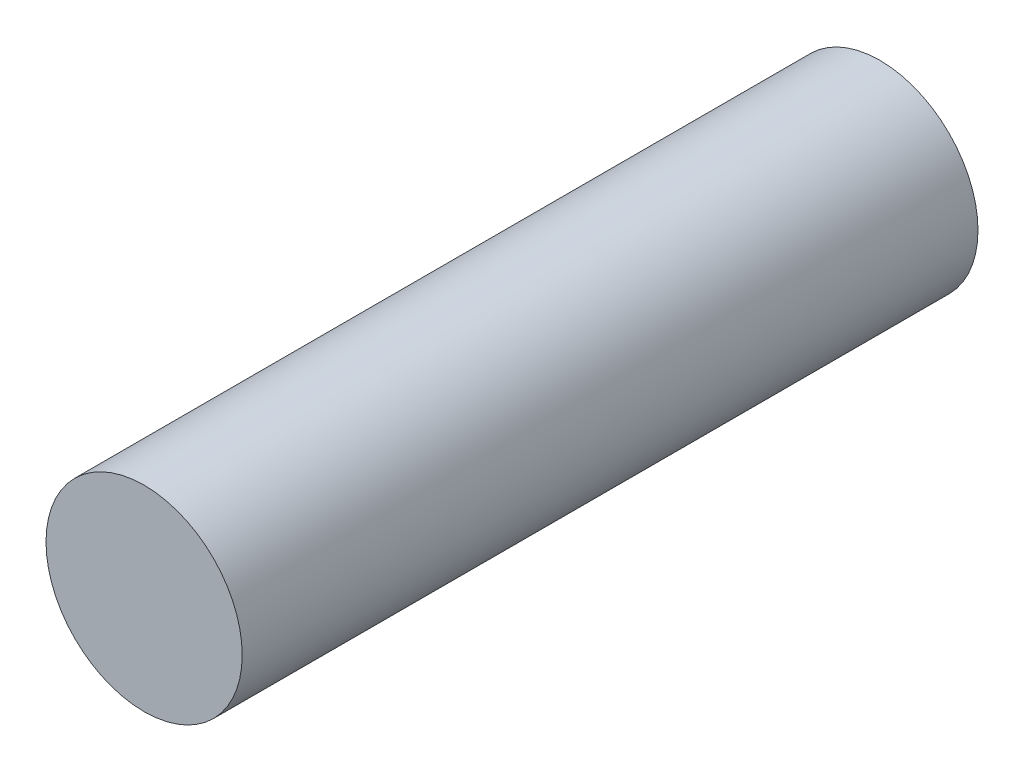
ISO-10303-21;
HEADER;
FILE_DESCRIPTION(('STEP AP214'),'2;1');
FILE_NAME('part.step','',(''),(''),'','','');
FILE_SCHEMA(('AUTOMOTIVE_DESIGN { 1 0 10303 214 1 1 1 1 }'));
ENDSEC;
DATA;
#1=APPLICATION_CONTEXT('core data for automotive mechanical design processes');
#2=APPLICATION_PROTOCOL_DEFINITION('international standard','automotive_design',2000,#1);
#3=PRODUCT_CONTEXT('',#1,'mechanical');
#4=PRODUCT('Part','Part','',(#3));
#5=PRODUCT_RELATED_PRODUCT_CATEGORY('part','',(#4));
#6=PRODUCT_DEFINITION_FORMATION('','',#4);
#7=PRODUCT_DEFINITION_CONTEXT('part definition',#1,'design');
#8=PRODUCT_DEFINITION('design','',#6,#7);
#9=PRODUCT_DEFINITION_SHAPE('','',#8);
#10=(LENGTH_UNIT() NAMED_UNIT(*) SI_UNIT(.MILLI.,.METRE.));
#11=(NAMED_UNIT(*) PLANE_ANGLE_UNIT() SI_UNIT($,.RADIAN.));
#12=(NAMED_UNIT(*) SI_UNIT($,.STERADIAN.) SOLID_ANGLE_UNIT());
#13=UNCERTAINTY_MEASURE_WITH_UNIT(LENGTH_MEASURE(1.E-05),#10,'distance_accuracy_value','');
#14=(GEOMETRIC_REPRESENTATION_CONTEXT(3) GLOBAL_UNCERTAINTY_ASSIGNED_CONTEXT((#13)) GLOBAL_UNIT_ASSIGNED_CONTEXT((#10,
#11,#12)) REPRESENTATION_CONTEXT('',''));
#15=CARTESIAN_POINT('',(0.,0.,0.));
#16=DIRECTION('',(0.,0.,1.));
#17=DIRECTION('',(1.,0.,0.));
#18=AXIS2_PLACEMENT_3D('',#15,#16,#17);
#19=CARTESIAN_POINT('',(0.,0.,-76.2));
#20=DIRECTION('',(0.,0.,1.));
#21=DIRECTION('',(1.,0.,0.));
#22=AXIS2_PLACEMENT_3D('',#19,#20,#21);
#23=CYLINDRICAL_SURFACE('',#22,10.16);
#24=CARTESIAN_POINT('',(0.,0.,-76.2));
#25=DIRECTION('',(0.,0.,1.));
#26=DIRECTION('',(1.,0.,0.));
#27=AXIS2_PLACEMENT_3D('',#24,#25,#26);
#28=CIRCLE('',#27,10.16);
#29=CARTESIAN_POINT('',(10.16,0.,-76.2));
#30=VERTEX_POINT('',#29);
#31=EDGE_CURVE('E10',#30,#30,#28,.T.);
#32=ORIENTED_EDGE('',*,*,#31,.T.);
#33=EDGE_LOOP('',(#32));
#34=FACE_BOUND('',#33,.T.);
#35=CARTESIAN_POINT('',(0.,0.,0.));
#36=DIRECTION('',(0.,0.,1.));
#37=DIRECTION('',(1.,0.,0.));
#38=AXIS2_PLACEMENT_3D('',#35,#36,#37);
#39=CIRCLE('',#38,10.16);
#40=CARTESIAN_POINT('',(10.16,0.,0.));
#41=VERTEX_POINT('',#40);
#42=EDGE_CURVE('E352',#41,#41,#39,.T.);
#43=ORIENTED_EDGE('',*,*,#42,.F.);
#44=EDGE_LOOP('',(#43));
#45=FACE_BOUND('',#44,.T.);
#46=ADVANCED_FACE('F346',(#34,#45),#23,.T.);
#47=CARTESIAN_POINT('',(0.,0.,-76.2));
#48=DIRECTION('',(0.,0.,1.));
#49=DIRECTION('',(1.,0.,0.));
#50=AXIS2_PLACEMENT_3D('',#47,#48,#49);
#51=PLANE('',#50);
#52=ORIENTED_EDGE('',*,*,#31,.F.);
#53=EDGE_LOOP('',(#52));
#54=FACE_BOUND('',#53,.T.);
#55=ADVANCED_FACE('F361',(#54),#51,.F.);
#56=CARTESIAN_POINT('',(0.,0.,0.));
#57=DIRECTION('',(0.,0.,1.));
#58=DIRECTION('',(1.,0.,0.));
#59=AXIS2_PLACEMENT_3D('',#56,#57,#58);
#60=PLANE('',#59);
#61=ORIENTED_EDGE('',*,*,#42,.T.);
#62=EDGE_LOOP('',(#61));
#63=FACE_BOUND('',#62,.T.);
#64=ADVANCED_FACE('F358',(#63),#60,.T.);
#65=CLOSED_SHELL('',(#46,#55,#64));
#66=MANIFOLD_SOLID_BREP('B2',#65);
#67=ADVANCED_BREP_SHAPE_REPRESENTATION('',(#18,#66),#14);
#68=SHAPE_DEFINITION_REPRESENTATION(#9,#67);
ENDSEC;
END-ISO-10303-21;
